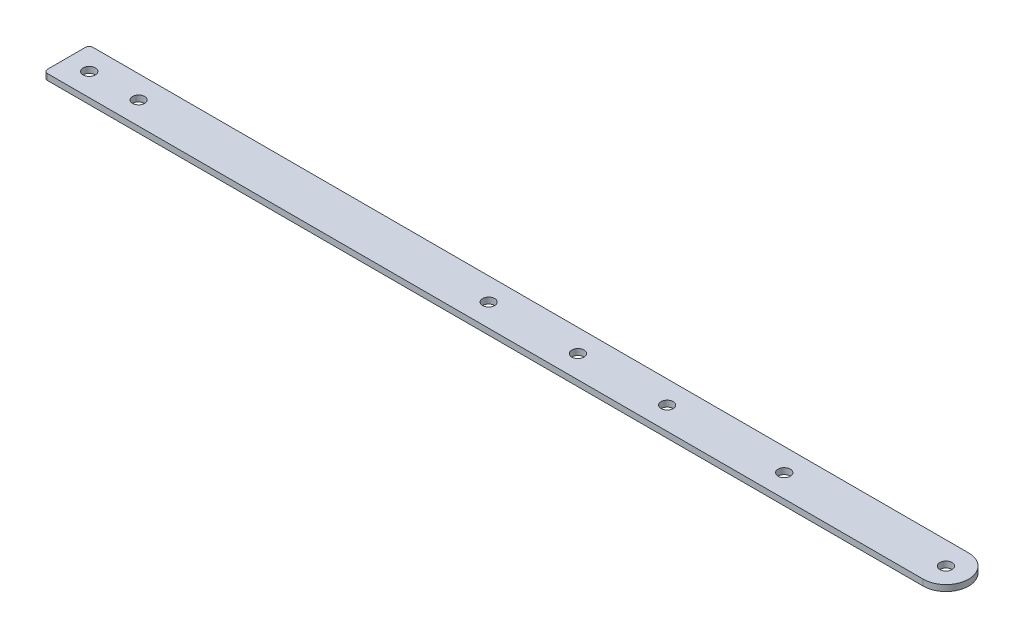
from build123d import *

# Parameters (mm, degrees)
SCHIZZO1_R                   = 4.05
SCHIZZO1_R_2                 = 4.049999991
SCHIZZO1_R_3                 = 4
ESTRUSIONE_ESTRUSIONE1_DEPTH = 4


with BuildPart() as part:
    # Schizzo1 → Estrusione-Estrusione1 (new body)
    with BuildSketch(Plane(origin=(0, 0, 0), x_dir=(1, 0, 0), z_dir=(0, 1, 0))):
        with BuildLine():
            Line((1483.561692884, 2001.553346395), (2061.747117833, 2001.553346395))
            ThreePointArc((2061.747117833, 2001.553346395), (2076.747117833, 2016.553346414), (2061.747117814, 2031.553346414))
            Line((2061.747117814, 2031.553346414), (1483.561692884, 2031.553346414))
            ThreePointArc((1483.561692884, 2031.553346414), (1481.793925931, 2030.821113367), (1481.061692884, 2029.053346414))
            Line((1481.061692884, 2029.053346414), (1481.061692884, 2004.053346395))
            ThreePointArc((1481.061692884, 2004.053346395), (1481.793925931, 2002.285579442), (1483.561692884, 2001.553346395))
        make_face()
        with Locations(Location((1496.061692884, 2016.553346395, 0), (0, 0, 270))):
            Circle(SCHIZZO1_R, mode=Mode.SUBTRACT)
        with Locations(Location((2061.747117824, 2016.553346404, 0), (0, 0, 270))):
            Circle(SCHIZZO1_R_2, mode=Mode.SUBTRACT)
        with Locations(Location((1954.979201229, 2016.553346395, 0), (0, 0, 270))):
            Circle(SCHIZZO1_R, mode=Mode.SUBTRACT)
        with Locations(Location((1818.752530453, 2016.553346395, 0), (0, 0, 270))):
            Circle(SCHIZZO1_R, mode=Mode.SUBTRACT)
        with Locations(Location((1877.670038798, 2016.553346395, 0), (0, 0, 270))):
            Circle(SCHIZZO1_R_3, mode=Mode.SUBTRACT)
        with Locations(Location((1759.835022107, 2016.553346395, 0), (0, 0, 270))):
            Circle(SCHIZZO1_R_3, mode=Mode.SUBTRACT)
        with Locations(Location((1528.666966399, 2016.553346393, 0), (0, 0, 270))):
            Circle(SCHIZZO1_R_3, mode=Mode.SUBTRACT)
    extrude(amount=ESTRUSIONE_ESTRUSIONE1_DEPTH)


solid = part.part
